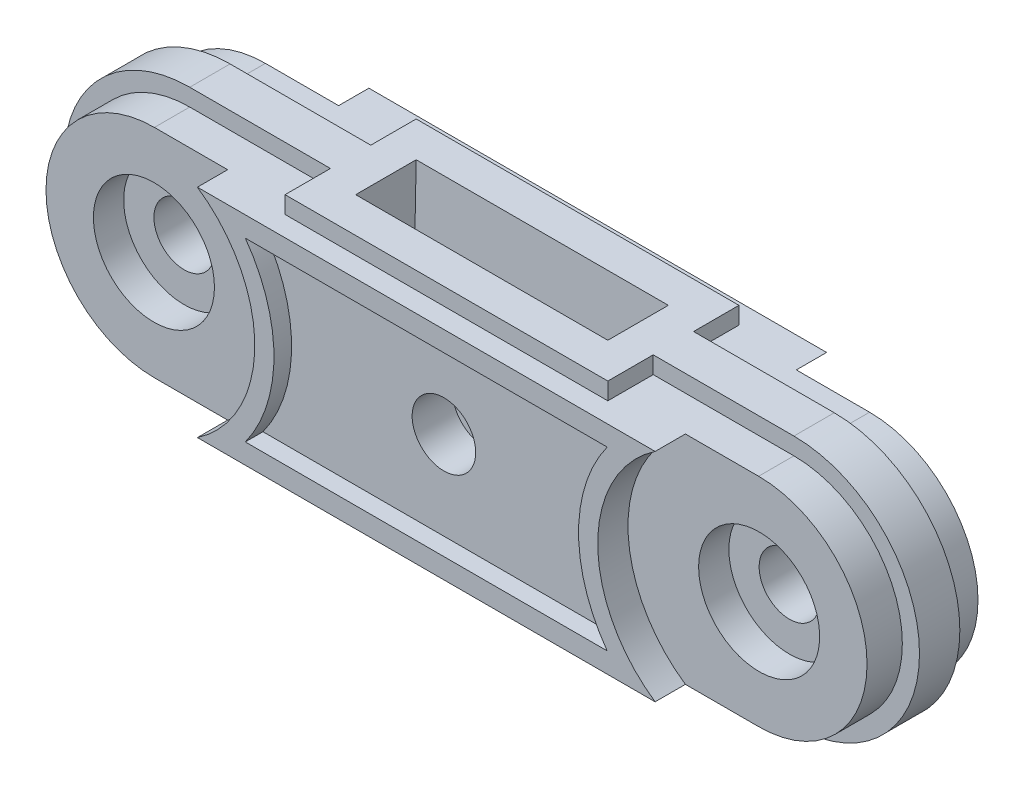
from build123d import *

# Parameters (mm, degrees)
EXTRUDE1_DEPTH          = 21.5
SKETCH16_R              = 3
EXTRUDE12_DEPTH         = 50.068727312
EXTRUDE18_DEPTH         = 50.068727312
EXTRUDE19_DEPTH         = 1.75
EXTRUDE20_DEPTH         = 2
SKETCH20_W              = 32
SKETCH20_H              = 4.5
EXTRUDE21_DEPTH         = 1.7
MIRROR4_COPY_1_SKETCH_W = 32
MIRROR4_COPY_1_SKETCH_H = 4.5
MIRROR4_COPY_1_DEPTH    = 1.7
EXTRUDE22_DEPTH         = 12.5
SKETCH23_R              = 3.15
EXTRUDE23_DEPTH         = 51.680987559
SKETCH24_R              = 13
EXTRUDE24_DEPTH         = 3
SKETCH25_R              = 6
EXTRUDE25_DEPTH         = 3


with BuildPart() as part:
    # Sketch1 → Extrude1 (new body)
    with BuildSketch(Plane(origin=(0, 0, 0), x_dir=(1, 0, 0), z_dir=(0, 1, 0))):
        Polygon((0, 0), (40.7, 0), (40.7, -17), (0, -17), (-40.7, -17), (-40.7, 0), align=None)
    extrude(amount=EXTRUDE1_DEPTH)

    # Sketch16 → Extrude12 (cut, through all)
    with BuildSketch(Plane(origin=(0, 0, 0), x_dir=(-1, 0, 0), z_dir=(0, 0, -1))):
        with Locations((-30, 10.75)):
            Circle(SKETCH16_R)
        with Locations(Location((30, 10.75, 0), (0, 0, 180))):
            Circle(SKETCH16_R)
    extrude(amount=-EXTRUDE12_DEPTH, mode=Mode.SUBTRACT)

    # Sketch17 → Extrude18 (cut, through all)
    with BuildSketch(Plane(origin=(0, 0, 0), x_dir=(-1, 0, 0), z_dir=(0, 0, -1))):
        with BuildLine():
            Line((40.7, 10.75), (40.7, 21.5))
            Line((40.7, 21.5), (29.95, 21.5))
            ThreePointArc((29.95, 21.5), (37.551397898, 18.351397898), (40.7, 10.75))
        make_face()
        with BuildLine():
            Line((40.7, 0), (40.7, 10.75))
            ThreePointArc((40.7, 10.75), (37.551397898, 3.148602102), (29.95, 0))
            Line((29.95, 0), (40.7, 0))
        make_face()
        with BuildLine():
            ThreePointArc((-40.7, 10.75), (-37.551397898, 18.351397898), (-29.95, 21.5))
            Line((-29.95, 21.5), (-40.7, 21.5))
            Line((-40.7, 21.5), (-40.7, 10.75))
        make_face()
        with BuildLine():
            Line((-40.7, 0), (-29.95, 0))
            ThreePointArc((-29.95, 0), (-37.551397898, 3.148602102), (-40.7, 10.75))
            Line((-40.7, 10.75), (-40.7, 0))
        make_face()
    extrude(amount=-EXTRUDE18_DEPTH, mode=Mode.SUBTRACT)

    # Sketch18 → Extrude19 (cut)
    with BuildSketch(Plane.XY.offset(17)):
        with BuildLine():
            Line((-17.93983831, 19.5), (17.93983831, 19.5))
            ThreePointArc((17.93983831, 19.5), (15.1, 10.75), (17.93983831, 2))
            Line((17.93983831, 2), (-17.93983831, 2))
            ThreePointArc((-17.93983831, 2), (-15.1, 10.75), (-17.93983831, 19.5))
        make_face()
    extrude19 = extrude(amount=-EXTRUDE19_DEPTH, mode=Mode.SUBTRACT)

    # Sketch19 → Extrude20 (add, symmetric)
    with BuildSketch(Plane.XY.offset(8.5)):
        with BuildLine():
            Line((-29.95, 23.2), (29.95, 23.2))
            ThreePointArc((29.95, 23.2), (42.4, 10.75), (29.95, -1.7))
            Line((29.95, -1.7), (-29.95, -1.7))
            ThreePointArc((-29.95, -1.7), (-42.4, 10.75), (-29.95, 23.2))
        make_face()
        with BuildLine():
            Line((-29.95, 0), (29.95, 0))
            ThreePointArc((29.95, 0), (40.7, 10.75), (29.95, 21.5))
            Line((29.95, 21.5), (-29.95, 21.5))
            ThreePointArc((-29.95, 21.5), (-40.7, 10.75), (-29.95, 0))
        make_face(mode=Mode.SUBTRACT)
    extrude(amount=EXTRUDE20_DEPTH, both=True)

    # Mirror1: Extrude19 across plane
    add(extrude19.mirror(Plane.XY.offset(8.5)), mode=Mode.SUBTRACT)

    # Sketch20 → Extrude21 (add)
    with BuildSketch(Plane(origin=(0, 21.5, 0), x_dir=(1, 0, 0), z_dir=(0, 1, 0))):
        with Locations((0, -4.25)):
            Rectangle(SKETCH20_W, SKETCH20_H)
    extrude21 = extrude(amount=EXTRUDE21_DEPTH)

    # Mirror2: Extrude21 across plane
    add(extrude21.mirror(Plane.XY.offset(8.5)))

    # Mirror4: Extrude21 across plane
    add(extrude21.mirror(Plane.ZX.offset(10.75)))

    # Mirror4 copy 1 sketch → Mirror4 copy 1 (add)
    with BuildSketch(Plane(origin=(0, 0, 17), x_dir=(1, 0, 0), z_dir=(0, -1, 0))):
        with Locations((0, -4.25)):
            Rectangle(MIRROR4_COPY_1_SKETCH_W, MIRROR4_COPY_1_SKETCH_H)
    extrude(amount=MIRROR4_COPY_1_DEPTH)

    # Sketch22 → Extrude22 (cut, symmetric)
    with BuildSketch(Plane(origin=(0, 0, 0), x_dir=(0, 0, -1), z_dir=(1, 0, 0))):
        Polygon((-6.5, 23.2), (-5.5, 23.2), (-6, -1.7), (-6.5, -1.7), (-10.5, -1.7), (-11, -1.7), (-11.5, 23.2), (-10.5, 23.2), align=None)
    extrude(amount=EXTRUDE22_DEPTH, both=True, mode=Mode.SUBTRACT)

    # Sketch23 → Extrude23 (cut, through all)
    with BuildSketch(Plane(origin=(0, 0, 1.75), x_dir=(-1, 0, 0), z_dir=(0, 0, -1))):
        with Locations(Location((0, 10.75, 0), (0, 0, 270))):
            Circle(SKETCH23_R)
    extrude(amount=-EXTRUDE23_DEPTH, mode=Mode.SUBTRACT)

    # Sketch24 → Extrude24 (cut)
    with BuildSketch(Plane.XY.offset(17)):
        with Locations((-30, 10.75)):
            Circle(SKETCH24_R)
        with Locations((30, 10.75)):
            Circle(SKETCH24_R)
    extrude24 = extrude(amount=-EXTRUDE24_DEPTH, mode=Mode.SUBTRACT)

    # Mirror5: Extrude24 across plane
    add(extrude24.mirror(Plane.XY.offset(8.5)), mode=Mode.SUBTRACT)

    # Sketch25 → Extrude25 (cut)
    with BuildSketch(Plane.XY.offset(14)):
        with Locations((-30, 10.75)):
            Circle(SKETCH25_R)
        with Locations(Location((30, 10.75, 0), (0, 0, 180))):
            Circle(SKETCH25_R)
    extrude25 = extrude(amount=-EXTRUDE25_DEPTH, mode=Mode.SUBTRACT)

    # Mirror6: Extrude25 across plane
    add(extrude25.mirror(Plane.XY.offset(8.5)), mode=Mode.SUBTRACT)


solid = part.part
